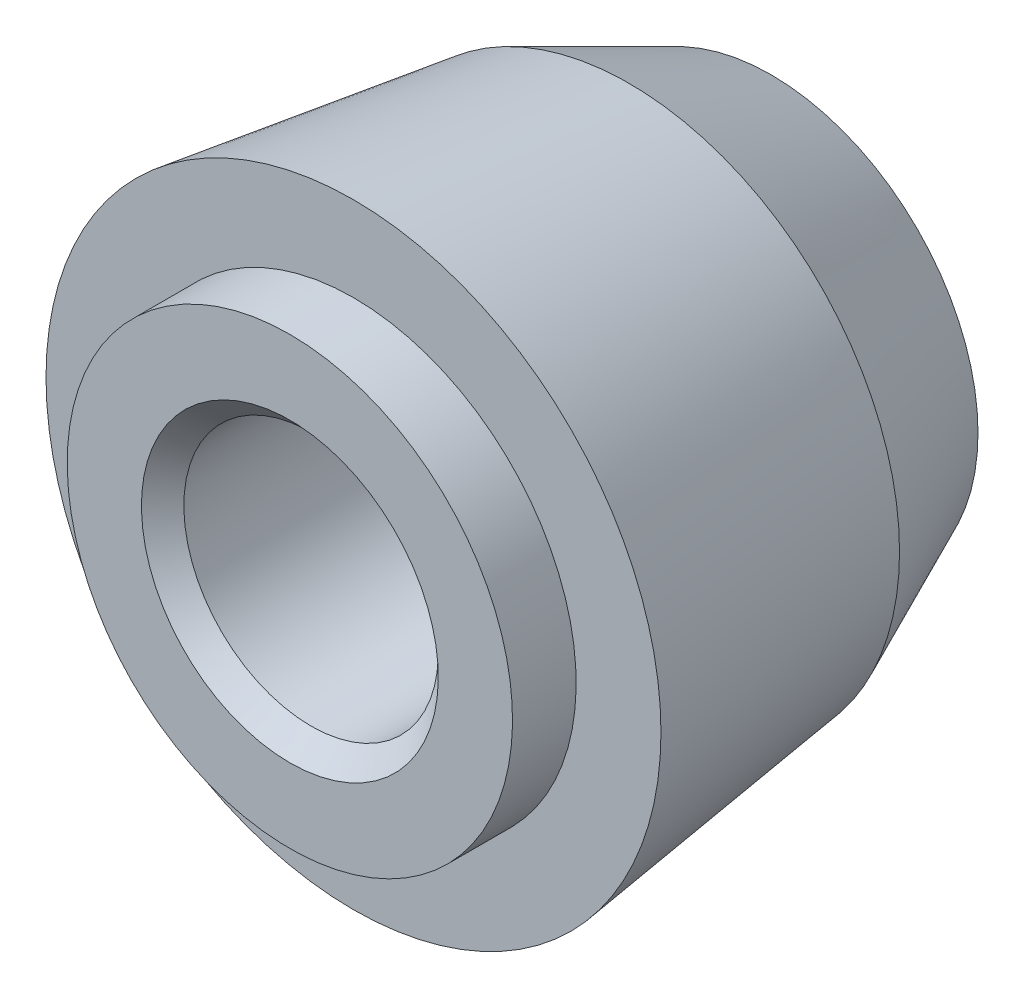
ISO-10303-21;
HEADER;
FILE_DESCRIPTION(('STEP AP214'),'2;1');
FILE_NAME('part.step','',(''),(''),'','','');
FILE_SCHEMA(('AUTOMOTIVE_DESIGN { 1 0 10303 214 1 1 1 1 }'));
ENDSEC;
DATA;
#1=APPLICATION_CONTEXT('core data for automotive mechanical design processes');
#2=APPLICATION_PROTOCOL_DEFINITION('international standard','automotive_design',2000,#1);
#3=PRODUCT_CONTEXT('',#1,'mechanical');
#4=PRODUCT('Part','Part','',(#3));
#5=PRODUCT_RELATED_PRODUCT_CATEGORY('part','',(#4));
#6=PRODUCT_DEFINITION_FORMATION('','',#4);
#7=PRODUCT_DEFINITION_CONTEXT('part definition',#1,'design');
#8=PRODUCT_DEFINITION('design','',#6,#7);
#9=PRODUCT_DEFINITION_SHAPE('','',#8);
#10=(LENGTH_UNIT() NAMED_UNIT(*) SI_UNIT(.MILLI.,.METRE.));
#11=(NAMED_UNIT(*) PLANE_ANGLE_UNIT() SI_UNIT($,.RADIAN.));
#12=(NAMED_UNIT(*) SI_UNIT($,.STERADIAN.) SOLID_ANGLE_UNIT());
#13=UNCERTAINTY_MEASURE_WITH_UNIT(LENGTH_MEASURE(1.E-05),#10,'distance_accuracy_value','');
#14=(GEOMETRIC_REPRESENTATION_CONTEXT(3) GLOBAL_UNCERTAINTY_ASSIGNED_CONTEXT((#13)) GLOBAL_UNIT_ASSIGNED_CONTEXT((#10,
#11,#12)) REPRESENTATION_CONTEXT('',''));
#15=CARTESIAN_POINT('',(0.,0.,0.));
#16=DIRECTION('',(0.,0.,1.));
#17=DIRECTION('',(1.,0.,0.));
#18=AXIS2_PLACEMENT_3D('',#15,#16,#17);
#19=CARTESIAN_POINT('',(8.25,0.,22.7));
#20=DIRECTION('',(0.,0.,1.));
#21=DIRECTION('',(0.,-1.,0.));
#22=AXIS2_PLACEMENT_3D('',#19,#20,#21);
#23=PLANE('',#22);
#24=CARTESIAN_POINT('',(0.,0.,22.7));
#25=DIRECTION('',(0.,0.,1.));
#26=DIRECTION('',(0.,-1.,0.));
#27=AXIS2_PLACEMENT_3D('',#24,#25,#26);
#28=CIRCLE('',#27,6.99999999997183);
#29=CARTESIAN_POINT('',(0.,-6.99999999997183,22.7));
#30=VERTEX_POINT('',#29);
#31=EDGE_CURVE('E8',#30,#30,#28,.F.);
#32=ORIENTED_EDGE('',*,*,#31,.T.);
#33=EDGE_LOOP('',(#32));
#34=FACE_BOUND('',#33,.T.);
#35=CARTESIAN_POINT('',(0.,0.,22.7));
#36=DIRECTION('',(0.,0.,-1.));
#37=DIRECTION('',(0.,1.,0.));
#38=AXIS2_PLACEMENT_3D('',#35,#36,#37);
#39=CIRCLE('',#38,10.5);
#40=CARTESIAN_POINT('',(0.,10.5,22.7));
#41=VERTEX_POINT('',#40);
#42=EDGE_CURVE('E30',#41,#41,#39,.T.);
#43=ORIENTED_EDGE('',*,*,#42,.F.);
#44=EDGE_LOOP('',(#43));
#45=FACE_BOUND('',#44,.T.);
#46=ADVANCED_FACE('F12',(#34,#45),#23,.T.);
#47=CARTESIAN_POINT('',(4.875,0.,0.));
#48=DIRECTION('',(0.,0.,-1.));
#49=DIRECTION('',(0.,1.,0.));
#50=AXIS2_PLACEMENT_3D('',#47,#48,#49);
#51=PLANE('',#50);
#52=CARTESIAN_POINT('',(0.,0.,0.));
#53=DIRECTION('',(0.,0.,1.));
#54=DIRECTION('',(0.,-1.,0.));
#55=AXIS2_PLACEMENT_3D('',#52,#53,#54);
#56=CIRCLE('',#55,9.75);
#57=CARTESIAN_POINT('',(0.,-9.75,0.));
#58=VERTEX_POINT('',#57);
#59=EDGE_CURVE('E33',#58,#58,#56,.T.);
#60=ORIENTED_EDGE('',*,*,#59,.F.);
#61=EDGE_LOOP('',(#60));
#62=FACE_BOUND('',#61,.T.);
#63=ADVANCED_FACE('F79',(#62),#51,.T.);
#64=CARTESIAN_POINT('',(0.,0.,21.2));
#65=DIRECTION('',(0.,0.,-1.));
#66=DIRECTION('',(0.,1.,0.));
#67=AXIS2_PLACEMENT_3D('',#64,#65,#66);
#68=CYLINDRICAL_SURFACE('',#67,10.5);
#69=ORIENTED_EDGE('',*,*,#42,.T.);
#70=EDGE_LOOP('',(#69));
#71=FACE_BOUND('',#70,.T.);
#72=CARTESIAN_POINT('',(0.,0.,19.7));
#73=DIRECTION('',(0.,0.,-1.));
#74=DIRECTION('',(0.,1.,0.));
#75=AXIS2_PLACEMENT_3D('',#72,#73,#74);
#76=CIRCLE('',#75,10.5);
#77=CARTESIAN_POINT('',(0.,10.5,19.7));
#78=VERTEX_POINT('',#77);
#79=EDGE_CURVE('E37',#78,#78,#76,.T.);
#80=ORIENTED_EDGE('',*,*,#79,.F.);
#81=EDGE_LOOP('',(#80));
#82=FACE_BOUND('',#81,.T.);
#83=ADVANCED_FACE('F75',(#71,#82),#68,.T.);
#84=CARTESIAN_POINT('',(0.,0.,6.7));
#85=DIRECTION('',(0.,0.,1.));
#86=DIRECTION('',(0.,-1.,0.));
#87=AXIS2_PLACEMENT_3D('',#84,#85,#86);
#88=CONICAL_SURFACE('',#87,12.75,0.420990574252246);
#89=ORIENTED_EDGE('',*,*,#59,.T.);
#90=EDGE_LOOP('',(#89));
#91=FACE_BOUND('',#90,.T.);
#92=CARTESIAN_POINT('',(0.,0.,6.7));
#93=DIRECTION('',(0.,0.,1.));
#94=DIRECTION('',(1.,0.,0.));
#95=AXIS2_PLACEMENT_3D('',#92,#93,#94);
#96=CIRCLE('',#95,12.75);
#97=CARTESIAN_POINT('',(12.75,0.,6.7));
#98=VERTEX_POINT('',#97);
#99=EDGE_CURVE('E27',#98,#98,#96,.T.);
#100=ORIENTED_EDGE('',*,*,#99,.F.);
#101=EDGE_LOOP('',(#100));
#102=FACE_BOUND('',#101,.T.);
#103=ADVANCED_FACE('F68',(#91,#102),#88,.T.);
#104=CARTESIAN_POINT('',(12.5,0.,19.7));
#105=DIRECTION('',(0.,0.,1.));
#106=DIRECTION('',(0.,-1.,0.));
#107=AXIS2_PLACEMENT_3D('',#104,#105,#106);
#108=PLANE('',#107);
#109=CARTESIAN_POINT('',(0.,0.,19.7));
#110=DIRECTION('',(0.,0.,1.));
#111=DIRECTION('',(0.,-1.,0.));
#112=AXIS2_PLACEMENT_3D('',#109,#110,#111);
#113=CIRCLE('',#112,14.5);
#114=CARTESIAN_POINT('',(0.,-14.5,19.7));
#115=VERTEX_POINT('',#114);
#116=EDGE_CURVE('E23',#115,#115,#113,.F.);
#117=ORIENTED_EDGE('',*,*,#116,.F.);
#118=EDGE_LOOP('',(#117));
#119=FACE_BOUND('',#118,.T.);
#120=ORIENTED_EDGE('',*,*,#79,.T.);
#121=EDGE_LOOP('',(#120));
#122=FACE_BOUND('',#121,.T.);
#123=ADVANCED_FACE('F60',(#119,#122),#108,.T.);
#124=CARTESIAN_POINT('',(0.,0.,19.7));
#125=DIRECTION('',(0.,0.,1.));
#126=DIRECTION('',(0.,-1.,0.));
#127=AXIS2_PLACEMENT_3D('',#124,#125,#126);
#128=CONICAL_SURFACE('',#127,14.5,0.133810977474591);
#129=ORIENTED_EDGE('',*,*,#99,.T.);
#130=EDGE_LOOP('',(#129));
#131=FACE_BOUND('',#130,.T.);
#132=ORIENTED_EDGE('',*,*,#116,.T.);
#133=EDGE_LOOP('',(#132));
#134=FACE_BOUND('',#133,.T.);
#135=ADVANCED_FACE('F56',(#131,#134),#128,.T.);
#136=CARTESIAN_POINT('',(0.,0.,11.9));
#137=DIRECTION('',(0.,0.,1.));
#138=DIRECTION('',(0.,-1.,0.));
#139=AXIS2_PLACEMENT_3D('',#136,#137,#138);
#140=PLANE('',#139);
#141=CARTESIAN_POINT('',(0.,0.,11.9));
#142=DIRECTION('',(0.,0.,1.));
#143=DIRECTION('',(0.,-1.,0.));
#144=AXIS2_PLACEMENT_3D('',#141,#142,#143);
#145=CIRCLE('',#144,5.99999999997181);
#146=CARTESIAN_POINT('',(0.,-5.99999999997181,11.9));
#147=VERTEX_POINT('',#146);
#148=EDGE_CURVE('E34',#147,#147,#145,.T.);
#149=ORIENTED_EDGE('',*,*,#148,.T.);
#150=EDGE_LOOP('',(#149));
#151=FACE_BOUND('',#150,.T.);
#152=ADVANCED_FACE('F45',(#151),#140,.T.);
#153=CARTESIAN_POINT('',(0.,0.,11.9));
#154=DIRECTION('',(0.,0.,1.));
#155=DIRECTION('',(0.,-1.,0.));
#156=AXIS2_PLACEMENT_3D('',#153,#154,#155);
#157=CYLINDRICAL_SURFACE('',#156,5.99999999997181);
#158=CARTESIAN_POINT('',(0.,0.,21.7));
#159=DIRECTION('',(0.,0.,1.));
#160=DIRECTION('',(0.,-1.,0.));
#161=AXIS2_PLACEMENT_3D('',#158,#159,#160);
#162=CIRCLE('',#161,5.99999999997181);
#163=CARTESIAN_POINT('',(0.,-5.99999999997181,21.7));
#164=VERTEX_POINT('',#163);
#165=EDGE_CURVE('E19',#164,#164,#162,.T.);
#166=ORIENTED_EDGE('',*,*,#165,.T.);
#167=EDGE_LOOP('',(#166));
#168=FACE_BOUND('',#167,.T.);
#169=ORIENTED_EDGE('',*,*,#148,.F.);
#170=EDGE_LOOP('',(#169));
#171=FACE_BOUND('',#170,.T.);
#172=ADVANCED_FACE('F47',(#168,#171),#157,.F.);
#173=CARTESIAN_POINT('',(0.,0.,21.7));
#174=DIRECTION('',(0.,0.,1.));
#175=DIRECTION('',(0.,-1.,0.));
#176=AXIS2_PLACEMENT_3D('',#173,#174,#175);
#177=CONICAL_SURFACE('',#176,5.99999999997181,0.785398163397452);
#178=ORIENTED_EDGE('',*,*,#31,.F.);
#179=EDGE_LOOP('',(#178));
#180=FACE_BOUND('',#179,.T.);
#181=ORIENTED_EDGE('',*,*,#165,.F.);
#182=EDGE_LOOP('',(#181));
#183=FACE_BOUND('',#182,.T.);
#184=ADVANCED_FACE('F14',(#180,#183),#177,.F.);
#185=CLOSED_SHELL('',(#46,#63,#83,#103,#123,#135,#152,#172,#184));
#186=MANIFOLD_SOLID_BREP('B1',#185);
#187=ADVANCED_BREP_SHAPE_REPRESENTATION('',(#18,#186),#14);
#188=SHAPE_DEFINITION_REPRESENTATION(#9,#187);
ENDSEC;
END-ISO-10303-21;
